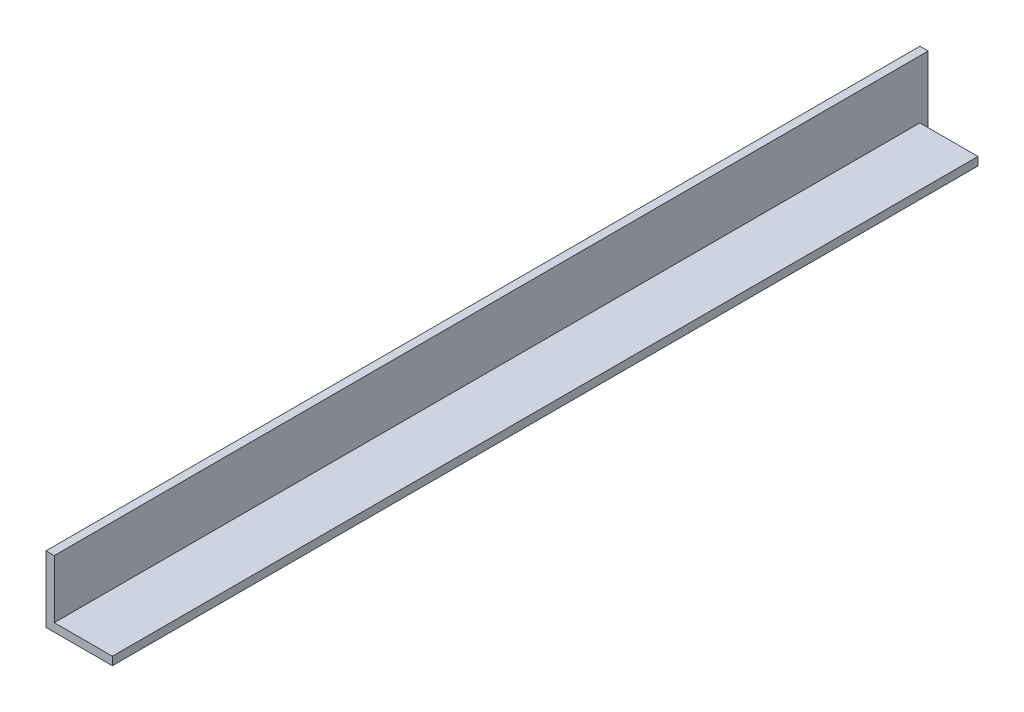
from build123d import *

# Parameters (mm, degrees)
BOSS_EXTRUDE1_DEPTH = 501.65
SKETCH2_W           = 33.3502
SKETCH2_H           = 4.7752
CUT_EXTRUDE1_DEPTH  = 505.535372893


with BuildPart() as part:
    # Sketch1 → Boss-Extrude1 (new body)
    with BuildSketch(Plane.XY):
        Polygon((0, 0), (0, 38.1), (4.7498, 38.1), (4.7498, 4.7498), (38.1, 4.7498), (38.1, 0), align=None)
    extrude(amount=BOSS_EXTRUDE1_DEPTH)

    # Sketch2 → Cut-Extrude1 (cut, through all)
    with BuildSketch(Plane.XZ):
        with Locations((21.4249, 2.3876)):
            Rectangle(SKETCH2_W, SKETCH2_H)
    extrude(amount=-CUT_EXTRUDE1_DEPTH, mode=Mode.SUBTRACT)


solid = part.part
